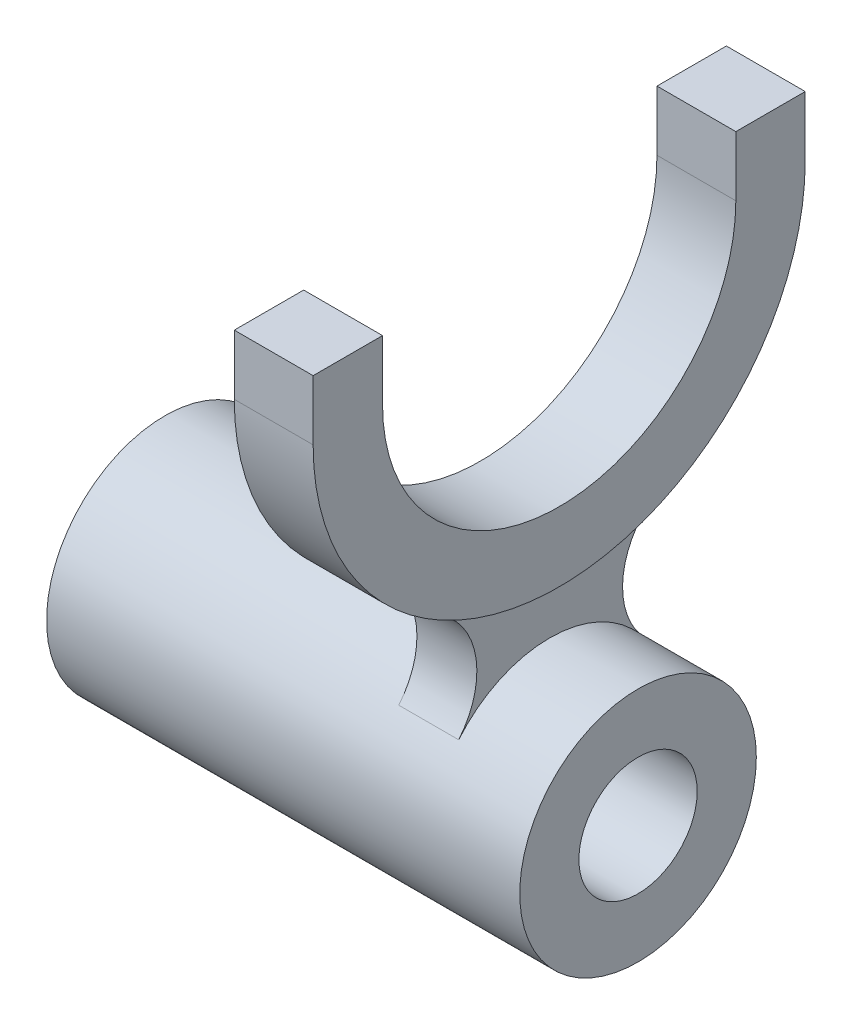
ISO-10303-21;
HEADER;
FILE_DESCRIPTION(('STEP AP214'),'2;1');
FILE_NAME('part.step','',(''),(''),'','','');
FILE_SCHEMA(('AUTOMOTIVE_DESIGN { 1 0 10303 214 1 1 1 1 }'));
ENDSEC;
DATA;
#1=APPLICATION_CONTEXT('core data for automotive mechanical design processes');
#2=APPLICATION_PROTOCOL_DEFINITION('international standard','automotive_design',2000,#1);
#3=PRODUCT_CONTEXT('',#1,'mechanical');
#4=PRODUCT('Part','Part','',(#3));
#5=PRODUCT_RELATED_PRODUCT_CATEGORY('part','',(#4));
#6=PRODUCT_DEFINITION_FORMATION('','',#4);
#7=PRODUCT_DEFINITION_CONTEXT('part definition',#1,'design');
#8=PRODUCT_DEFINITION('design','',#6,#7);
#9=PRODUCT_DEFINITION_SHAPE('','',#8);
#10=(LENGTH_UNIT() NAMED_UNIT(*) SI_UNIT(.MILLI.,.METRE.));
#11=(NAMED_UNIT(*) PLANE_ANGLE_UNIT() SI_UNIT($,.RADIAN.));
#12=(NAMED_UNIT(*) SI_UNIT($,.STERADIAN.) SOLID_ANGLE_UNIT());
#13=UNCERTAINTY_MEASURE_WITH_UNIT(LENGTH_MEASURE(1.E-05),#10,'distance_accuracy_value','');
#14=(GEOMETRIC_REPRESENTATION_CONTEXT(3) GLOBAL_UNCERTAINTY_ASSIGNED_CONTEXT((#13)) GLOBAL_UNIT_ASSIGNED_CONTEXT((#10,
#11,#12)) REPRESENTATION_CONTEXT('',''));
#15=CARTESIAN_POINT('',(0.,0.,0.));
#16=DIRECTION('',(0.,0.,1.));
#17=DIRECTION('',(1.,0.,0.));
#18=AXIS2_PLACEMENT_3D('',#15,#16,#17);
#19=CARTESIAN_POINT('',(-57.15,0.,0.));
#20=DIRECTION('',(1.,0.,0.));
#21=DIRECTION('',(0.,0.,-1.));
#22=AXIS2_PLACEMENT_3D('',#19,#20,#21);
#23=CYLINDRICAL_SURFACE('',#22,19.05);
#24=CARTESIAN_POINT('',(4.826,0.,0.));
#25=DIRECTION('',(-1.,0.,0.));
#26=DIRECTION('',(0.,0.,-1.));
#27=AXIS2_PLACEMENT_3D('',#24,#25,#26);
#28=CIRCLE('',#27,19.05);
#29=CARTESIAN_POINT('',(4.826,12.1666969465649,14.6585806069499));
#30=VERTEX_POINT('',#29);
#31=CARTESIAN_POINT('',(4.826,12.1666969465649,-14.6585806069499));
#32=VERTEX_POINT('',#31);
#33=EDGE_CURVE('E200',#30,#32,#28,.T.);
#34=ORIENTED_EDGE('',*,*,#33,.F.);
#35=DIRECTION('',(-1.,0.,0.));
#36=VECTOR('',#35,1.);
#37=CARTESIAN_POINT('',(4.826,12.1666969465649,14.6585806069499));
#38=LINE('',#37,#36);
#39=CARTESIAN_POINT('',(-4.826,12.1666969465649,14.6585806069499));
#40=VERTEX_POINT('',#39);
#41=EDGE_CURVE('E222',#30,#40,#38,.T.);
#42=ORIENTED_EDGE('',*,*,#41,.T.);
#43=CARTESIAN_POINT('',(-4.826,0.,0.));
#44=DIRECTION('',(-1.,0.,0.));
#45=DIRECTION('',(0.,0.,-1.));
#46=AXIS2_PLACEMENT_3D('',#43,#44,#45);
#47=CIRCLE('',#46,19.05);
#48=CARTESIAN_POINT('',(-4.826,12.1666969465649,-14.6585806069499));
#49=VERTEX_POINT('',#48);
#50=EDGE_CURVE('E209',#40,#49,#47,.T.);
#51=ORIENTED_EDGE('',*,*,#50,.T.);
#52=DIRECTION('',(-1.,0.,0.));
#53=VECTOR('',#52,1.);
#54=CARTESIAN_POINT('',(4.826,12.1666969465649,-14.6585806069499));
#55=LINE('',#54,#53);
#56=EDGE_CURVE('E220',#32,#49,#55,.T.);
#57=ORIENTED_EDGE('',*,*,#56,.F.);
#58=EDGE_LOOP('',(#34,#42,#51,#57));
#59=FACE_BOUND('',#58,.T.);
#60=CARTESIAN_POINT('',(-57.15,0.,0.));
#61=DIRECTION('',(1.,0.,0.));
#62=DIRECTION('',(0.,0.,-1.));
#63=AXIS2_PLACEMENT_3D('',#60,#61,#62);
#64=CIRCLE('',#63,19.05);
#65=CARTESIAN_POINT('',(-57.15,0.,-19.05));
#66=VERTEX_POINT('',#65);
#67=EDGE_CURVE('E11',#66,#66,#64,.T.);
#68=ORIENTED_EDGE('',*,*,#67,.T.);
#69=EDGE_LOOP('',(#68));
#70=FACE_BOUND('',#69,.T.);
#71=CARTESIAN_POINT('',(19.05,0.,0.));
#72=DIRECTION('',(1.,0.,0.));
#73=DIRECTION('',(0.,0.,-1.));
#74=AXIS2_PLACEMENT_3D('',#71,#72,#73);
#75=CIRCLE('',#74,19.05);
#76=CARTESIAN_POINT('',(19.05,0.,-19.05));
#77=VERTEX_POINT('',#76);
#78=EDGE_CURVE('E228',#77,#77,#75,.T.);
#79=ORIENTED_EDGE('',*,*,#78,.F.);
#80=EDGE_LOOP('',(#79));
#81=FACE_BOUND('',#80,.T.);
#82=ADVANCED_FACE('F33',(#59,#70,#81),#23,.T.);
#83=CARTESIAN_POINT('',(-57.15,0.,0.));
#84=DIRECTION('',(1.,0.,0.));
#85=DIRECTION('',(0.,0.,-1.));
#86=AXIS2_PLACEMENT_3D('',#83,#84,#85);
#87=PLANE('',#86);
#88=CARTESIAN_POINT('',(-57.15,0.,0.));
#89=DIRECTION('',(1.,0.,0.));
#90=DIRECTION('',(0.,0.,-1.));
#91=AXIS2_PLACEMENT_3D('',#88,#89,#90);
#92=CIRCLE('',#91,9.525);
#93=CARTESIAN_POINT('',(-57.15,0.,-9.525));
#94=VERTEX_POINT('',#93);
#95=EDGE_CURVE('E40',#94,#94,#92,.T.);
#96=ORIENTED_EDGE('',*,*,#95,.T.);
#97=EDGE_LOOP('',(#96));
#98=FACE_BOUND('',#97,.T.);
#99=ORIENTED_EDGE('',*,*,#67,.F.);
#100=EDGE_LOOP('',(#99));
#101=FACE_BOUND('',#100,.T.);
#102=ADVANCED_FACE('F233',(#98,#101),#87,.F.);
#103=CARTESIAN_POINT('',(-57.15,0.,0.));
#104=DIRECTION('',(1.,0.,0.));
#105=DIRECTION('',(0.,0.,-1.));
#106=AXIS2_PLACEMENT_3D('',#103,#104,#105);
#107=CYLINDRICAL_SURFACE('',#106,9.525);
#108=ORIENTED_EDGE('',*,*,#95,.F.);
#109=EDGE_LOOP('',(#108));
#110=FACE_BOUND('',#109,.T.);
#111=CARTESIAN_POINT('',(19.05,0.,0.));
#112=DIRECTION('',(1.,0.,0.));
#113=DIRECTION('',(0.,0.,-1.));
#114=AXIS2_PLACEMENT_3D('',#111,#112,#113);
#115=CIRCLE('',#114,9.525);
#116=CARTESIAN_POINT('',(19.05,0.,-9.525));
#117=VERTEX_POINT('',#116);
#118=EDGE_CURVE('E225',#117,#117,#115,.T.);
#119=ORIENTED_EDGE('',*,*,#118,.T.);
#120=EDGE_LOOP('',(#119));
#121=FACE_BOUND('',#120,.T.);
#122=ADVANCED_FACE('F236',(#110,#121),#107,.F.);
#123=CARTESIAN_POINT('',(19.05,0.,0.));
#124=DIRECTION('',(1.,0.,0.));
#125=DIRECTION('',(0.,0.,-1.));
#126=AXIS2_PLACEMENT_3D('',#123,#124,#125);
#127=PLANE('',#126);
#128=ORIENTED_EDGE('',*,*,#78,.T.);
#129=EDGE_LOOP('',(#128));
#130=FACE_BOUND('',#129,.T.);
#131=ORIENTED_EDGE('',*,*,#118,.F.);
#132=EDGE_LOOP('',(#131));
#133=FACE_BOUND('',#132,.T.);
#134=ADVANCED_FACE('F239',(#130,#133),#127,.T.);
#135=CARTESIAN_POINT('',(4.826,20.2778282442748,24.4309676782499));
#136=DIRECTION('',(-1.,0.,0.));
#137=DIRECTION('',(0.,0.,1.));
#138=AXIS2_PLACEMENT_3D('',#135,#136,#137);
#139=CYLINDRICAL_SURFACE('',#138,12.7);
#140=CARTESIAN_POINT('',(-4.826,20.2778282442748,24.4309676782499));
#141=DIRECTION('',(-1.,0.,0.));
#142=DIRECTION('',(0.,0.,-1.));
#143=AXIS2_PLACEMENT_3D('',#140,#141,#142);
#144=CIRCLE('',#143,12.7);
#145=CARTESIAN_POINT('',(-4.826,31.5084524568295,18.5011211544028));
#146=VERTEX_POINT('',#145);
#147=EDGE_CURVE('E147',#146,#40,#144,.T.);
#148=ORIENTED_EDGE('',*,*,#147,.T.);
#149=ORIENTED_EDGE('',*,*,#41,.F.);
#150=CARTESIAN_POINT('',(4.826,20.2778282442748,24.4309676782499));
#151=DIRECTION('',(-1.,0.,0.));
#152=DIRECTION('',(0.,0.,-1.));
#153=AXIS2_PLACEMENT_3D('',#150,#151,#152);
#154=CIRCLE('',#153,12.7);
#155=CARTESIAN_POINT('',(4.826,31.5084524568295,18.5011211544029));
#156=VERTEX_POINT('',#155);
#157=EDGE_CURVE('E70',#156,#30,#154,.T.);
#158=ORIENTED_EDGE('',*,*,#157,.F.);
#159=DIRECTION('',(-1.,0.,0.));
#160=VECTOR('',#159,1.);
#161=CARTESIAN_POINT('',(4.826,31.5084524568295,18.5011211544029));
#162=LINE('',#161,#160);
#163=EDGE_CURVE('E206',#156,#146,#162,.T.);
#164=ORIENTED_EDGE('',*,*,#163,.T.);
#165=EDGE_LOOP('',(#148,#149,#158,#164));
#166=FACE_BOUND('',#165,.T.);
#167=ADVANCED_FACE('F244',(#166),#139,.F.);
#168=CARTESIAN_POINT('',(4.826,20.2778282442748,-24.4309676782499));
#169=DIRECTION('',(-1.,0.,0.));
#170=DIRECTION('',(0.,0.,1.));
#171=AXIS2_PLACEMENT_3D('',#168,#169,#170);
#172=CYLINDRICAL_SURFACE('',#171,12.7);
#173=CARTESIAN_POINT('',(-4.826,20.2778282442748,-24.4309676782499));
#174=DIRECTION('',(-1.,0.,0.));
#175=DIRECTION('',(0.,0.,1.));
#176=AXIS2_PLACEMENT_3D('',#173,#174,#175);
#177=CIRCLE('',#176,12.7);
#178=CARTESIAN_POINT('',(-4.826,31.5084524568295,-18.5011211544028));
#179=VERTEX_POINT('',#178);
#180=EDGE_CURVE('E47',#49,#179,#177,.T.);
#181=ORIENTED_EDGE('',*,*,#180,.T.);
#182=DIRECTION('',(-1.,0.,0.));
#183=VECTOR('',#182,1.);
#184=CARTESIAN_POINT('',(4.826,31.5084524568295,-18.5011211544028));
#185=LINE('',#184,#183);
#186=CARTESIAN_POINT('',(4.826,31.5084524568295,-18.5011211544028));
#187=VERTEX_POINT('',#186);
#188=EDGE_CURVE('E217',#187,#179,#185,.T.);
#189=ORIENTED_EDGE('',*,*,#188,.F.);
#190=CARTESIAN_POINT('',(4.826,20.2778282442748,-24.4309676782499));
#191=DIRECTION('',(-1.,0.,0.));
#192=DIRECTION('',(0.,0.,1.));
#193=AXIS2_PLACEMENT_3D('',#190,#191,#192);
#194=CIRCLE('',#193,12.7);
#195=EDGE_CURVE('E203',#32,#187,#194,.T.);
#196=ORIENTED_EDGE('',*,*,#195,.F.);
#197=ORIENTED_EDGE('',*,*,#56,.T.);
#198=EDGE_LOOP('',(#181,#189,#196,#197));
#199=FACE_BOUND('',#198,.T.);
#200=ADVANCED_FACE('F250',(#199),#172,.F.);
#201=CARTESIAN_POINT('',(4.826,43.4129141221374,12.2154838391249));
#202=DIRECTION('',(1.,0.,0.));
#203=DIRECTION('',(0.,0.,-1.));
#204=AXIS2_PLACEMENT_3D('',#201,#202,#203);
#205=PLANE('',#204);
#206=ORIENTED_EDGE('',*,*,#157,.T.);
#207=ORIENTED_EDGE('',*,*,#33,.T.);
#208=ORIENTED_EDGE('',*,*,#195,.T.);
#209=CARTESIAN_POINT('',(4.826,66.548,0.));
#210=DIRECTION('',(-1.,0.,0.));
#211=DIRECTION('',(0.,0.,-1.));
#212=AXIS2_PLACEMENT_3D('',#209,#210,#211);
#213=CIRCLE('',#212,39.624);
#214=EDGE_CURVE('E56',#187,#156,#213,.T.);
#215=ORIENTED_EDGE('',*,*,#214,.T.);
#216=EDGE_LOOP('',(#206,#207,#208,#215));
#217=FACE_BOUND('',#216,.T.);
#218=ADVANCED_FACE('F265',(#217),#205,.T.);
#219=CARTESIAN_POINT('',(-4.826,43.4129141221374,12.2154838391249));
#220=DIRECTION('',(1.,0.,0.));
#221=DIRECTION('',(0.,0.,-1.));
#222=AXIS2_PLACEMENT_3D('',#219,#220,#221);
#223=PLANE('',#222);
#224=ORIENTED_EDGE('',*,*,#147,.F.);
#225=CARTESIAN_POINT('',(-4.826,66.548,0.));
#226=DIRECTION('',(-1.,0.,0.));
#227=DIRECTION('',(0.,0.,-1.));
#228=AXIS2_PLACEMENT_3D('',#225,#226,#227);
#229=CIRCLE('',#228,39.624);
#230=EDGE_CURVE('E201',#179,#146,#229,.T.);
#231=ORIENTED_EDGE('',*,*,#230,.F.);
#232=ORIENTED_EDGE('',*,*,#180,.F.);
#233=ORIENTED_EDGE('',*,*,#50,.F.);
#234=EDGE_LOOP('',(#224,#231,#232,#233));
#235=FACE_BOUND('',#234,.T.);
#236=ADVANCED_FACE('F270',(#235),#223,.F.);
#237=CARTESIAN_POINT('',(6.35,66.548,28.448));
#238=DIRECTION('',(0.,0.,1.));
#239=DIRECTION('',(1.,0.,0.));
#240=AXIS2_PLACEMENT_3D('',#237,#238,#239);
#241=PLANE('',#240);
#242=DIRECTION('',(0.,1.,0.));
#243=VECTOR('',#242,1.);
#244=CARTESIAN_POINT('',(-6.35,66.548,28.448));
#245=LINE('',#244,#243);
#246=CARTESIAN_POINT('',(-6.35,66.548,28.448));
#247=VERTEX_POINT('',#246);
#248=CARTESIAN_POINT('',(-6.35,76.2,28.448));
#249=VERTEX_POINT('',#248);
#250=EDGE_CURVE('E143',#247,#249,#245,.T.);
#251=ORIENTED_EDGE('',*,*,#250,.T.);
#252=DIRECTION('',(-1.,0.,0.));
#253=VECTOR('',#252,1.);
#254=CARTESIAN_POINT('',(6.35,76.2,28.448));
#255=LINE('',#254,#253);
#256=CARTESIAN_POINT('',(6.35,76.2,28.448));
#257=VERTEX_POINT('',#256);
#258=EDGE_CURVE('E140',#257,#249,#255,.T.);
#259=ORIENTED_EDGE('',*,*,#258,.F.);
#260=DIRECTION('',(0.,1.,0.));
#261=VECTOR('',#260,1.);
#262=CARTESIAN_POINT('',(6.35,66.548,28.448));
#263=LINE('',#262,#261);
#264=CARTESIAN_POINT('',(6.35,66.548,28.448));
#265=VERTEX_POINT('',#264);
#266=EDGE_CURVE('E125',#265,#257,#263,.T.);
#267=ORIENTED_EDGE('',*,*,#266,.F.);
#268=DIRECTION('',(-1.,0.,0.));
#269=VECTOR('',#268,1.);
#270=CARTESIAN_POINT('',(6.35,66.548,28.448));
#271=LINE('',#270,#269);
#272=EDGE_CURVE('E167',#265,#247,#271,.T.);
#273=ORIENTED_EDGE('',*,*,#272,.T.);
#274=EDGE_LOOP('',(#251,#259,#267,#273));
#275=FACE_BOUND('',#274,.T.);
#276=ADVANCED_FACE('F141',(#275),#241,.F.);
#277=CARTESIAN_POINT('',(6.35,76.2,39.624));
#278=DIRECTION('',(0.,1.,0.));
#279=DIRECTION('',(0.,0.,1.));
#280=AXIS2_PLACEMENT_3D('',#277,#278,#279);
#281=PLANE('',#280);
#282=DIRECTION('',(0.,0.,-1.));
#283=VECTOR('',#282,1.);
#284=CARTESIAN_POINT('',(-6.35,76.2,39.624));
#285=LINE('',#284,#283);
#286=CARTESIAN_POINT('',(-6.35,76.2,39.624));
#287=VERTEX_POINT('',#286);
#288=EDGE_CURVE('E169',#287,#249,#285,.T.);
#289=ORIENTED_EDGE('',*,*,#288,.F.);
#290=DIRECTION('',(-1.,0.,0.));
#291=VECTOR('',#290,1.);
#292=CARTESIAN_POINT('',(6.35,76.2,39.624));
#293=LINE('',#292,#291);
#294=CARTESIAN_POINT('',(6.35,76.2,39.624));
#295=VERTEX_POINT('',#294);
#296=EDGE_CURVE('E148',#295,#287,#293,.T.);
#297=ORIENTED_EDGE('',*,*,#296,.F.);
#298=DIRECTION('',(0.,0.,-1.));
#299=VECTOR('',#298,1.);
#300=CARTESIAN_POINT('',(6.35,76.2,39.624));
#301=LINE('',#300,#299);
#302=EDGE_CURVE('E130',#295,#257,#301,.T.);
#303=ORIENTED_EDGE('',*,*,#302,.T.);
#304=ORIENTED_EDGE('',*,*,#258,.T.);
#305=EDGE_LOOP('',(#289,#297,#303,#304));
#306=FACE_BOUND('',#305,.T.);
#307=ADVANCED_FACE('F150',(#306),#281,.T.);
#308=CARTESIAN_POINT('',(6.35,66.548,39.624));
#309=DIRECTION('',(0.,0.,1.));
#310=DIRECTION('',(1.,0.,0.));
#311=AXIS2_PLACEMENT_3D('',#308,#309,#310);
#312=PLANE('',#311);
#313=DIRECTION('',(0.,1.,0.));
#314=VECTOR('',#313,1.);
#315=CARTESIAN_POINT('',(-6.35,66.548,39.624));
#316=LINE('',#315,#314);
#317=CARTESIAN_POINT('',(-6.35,66.548,39.624));
#318=VERTEX_POINT('',#317);
#319=EDGE_CURVE('E171',#318,#287,#316,.T.);
#320=ORIENTED_EDGE('',*,*,#319,.F.);
#321=DIRECTION('',(-1.,0.,0.));
#322=VECTOR('',#321,1.);
#323=CARTESIAN_POINT('',(6.35,66.548,39.624));
#324=LINE('',#323,#322);
#325=CARTESIAN_POINT('',(6.35,66.548,39.624));
#326=VERTEX_POINT('',#325);
#327=EDGE_CURVE('E196',#326,#318,#324,.T.);
#328=ORIENTED_EDGE('',*,*,#327,.F.);
#329=DIRECTION('',(0.,1.,0.));
#330=VECTOR('',#329,1.);
#331=CARTESIAN_POINT('',(6.35,66.548,39.624));
#332=LINE('',#331,#330);
#333=EDGE_CURVE('E151',#326,#295,#332,.T.);
#334=ORIENTED_EDGE('',*,*,#333,.T.);
#335=ORIENTED_EDGE('',*,*,#296,.T.);
#336=EDGE_LOOP('',(#320,#328,#334,#335));
#337=FACE_BOUND('',#336,.T.);
#338=ADVANCED_FACE('F309',(#337),#312,.T.);
#339=CARTESIAN_POINT('',(6.35,66.548,0.));
#340=DIRECTION('',(-1.,0.,0.));
#341=DIRECTION('',(0.,0.,1.));
#342=AXIS2_PLACEMENT_3D('',#339,#340,#341);
#343=CYLINDRICAL_SURFACE('',#342,39.624);
#344=ORIENTED_EDGE('',*,*,#163,.F.);
#345=ORIENTED_EDGE('',*,*,#214,.F.);
#346=ORIENTED_EDGE('',*,*,#188,.T.);
#347=ORIENTED_EDGE('',*,*,#230,.T.);
#348=EDGE_LOOP('',(#344,#345,#346,#347));
#349=FACE_BOUND('',#348,.T.);
#350=CARTESIAN_POINT('',(-6.35,66.548,0.));
#351=DIRECTION('',(-1.,0.,0.));
#352=DIRECTION('',(0.,0.,-1.));
#353=AXIS2_PLACEMENT_3D('',#350,#351,#352);
#354=CIRCLE('',#353,39.624);
#355=CARTESIAN_POINT('',(-6.35,66.548,-39.624));
#356=VERTEX_POINT('',#355);
#357=EDGE_CURVE('E174',#356,#318,#354,.T.);
#358=ORIENTED_EDGE('',*,*,#357,.F.);
#359=DIRECTION('',(-1.,0.,0.));
#360=VECTOR('',#359,1.);
#361=CARTESIAN_POINT('',(6.35,66.548,-39.624));
#362=LINE('',#361,#360);
#363=CARTESIAN_POINT('',(6.35,66.548,-39.624));
#364=VERTEX_POINT('',#363);
#365=EDGE_CURVE('E194',#364,#356,#362,.T.);
#366=ORIENTED_EDGE('',*,*,#365,.F.);
#367=CARTESIAN_POINT('',(6.35,66.548,0.));
#368=DIRECTION('',(-1.,0.,0.));
#369=DIRECTION('',(0.,0.,-1.));
#370=AXIS2_PLACEMENT_3D('',#367,#368,#369);
#371=CIRCLE('',#370,39.624);
#372=EDGE_CURVE('E153',#364,#326,#371,.T.);
#373=ORIENTED_EDGE('',*,*,#372,.T.);
#374=ORIENTED_EDGE('',*,*,#327,.T.);
#375=EDGE_LOOP('',(#358,#366,#373,#374));
#376=FACE_BOUND('',#375,.T.);
#377=ADVANCED_FACE('F268',(#349,#376),#343,.T.);
#378=CARTESIAN_POINT('',(6.35,66.548,-39.624));
#379=DIRECTION('',(0.,0.,-1.));
#380=DIRECTION('',(-1.,0.,0.));
#381=AXIS2_PLACEMENT_3D('',#378,#379,#380);
#382=PLANE('',#381);
#383=DIRECTION('',(0.,-1.,0.));
#384=VECTOR('',#383,1.);
#385=CARTESIAN_POINT('',(-6.35,66.548,-39.624));
#386=LINE('',#385,#384);
#387=CARTESIAN_POINT('',(-6.35,76.2,-39.624));
#388=VERTEX_POINT('',#387);
#389=EDGE_CURVE('E177',#388,#356,#386,.T.);
#390=ORIENTED_EDGE('',*,*,#389,.F.);
#391=DIRECTION('',(-1.,0.,0.));
#392=VECTOR('',#391,1.);
#393=CARTESIAN_POINT('',(6.35,76.2,-39.624));
#394=LINE('',#393,#392);
#395=CARTESIAN_POINT('',(6.35,76.2,-39.624));
#396=VERTEX_POINT('',#395);
#397=EDGE_CURVE('E192',#396,#388,#394,.T.);
#398=ORIENTED_EDGE('',*,*,#397,.F.);
#399=DIRECTION('',(0.,-1.,0.));
#400=VECTOR('',#399,1.);
#401=CARTESIAN_POINT('',(6.35,66.548,-39.624));
#402=LINE('',#401,#400);
#403=EDGE_CURVE('E158',#396,#364,#402,.T.);
#404=ORIENTED_EDGE('',*,*,#403,.T.);
#405=ORIENTED_EDGE('',*,*,#365,.T.);
#406=EDGE_LOOP('',(#390,#398,#404,#405));
#407=FACE_BOUND('',#406,.T.);
#408=ADVANCED_FACE('F327',(#407),#382,.T.);
#409=CARTESIAN_POINT('',(6.35,76.2,-28.448));
#410=DIRECTION('',(0.,1.,0.));
#411=DIRECTION('',(0.,0.,1.));
#412=AXIS2_PLACEMENT_3D('',#409,#410,#411);
#413=PLANE('',#412);
#414=DIRECTION('',(0.,0.,-1.));
#415=VECTOR('',#414,1.);
#416=CARTESIAN_POINT('',(-6.35,76.2,-28.448));
#417=LINE('',#416,#415);
#418=CARTESIAN_POINT('',(-6.35,76.2,-28.448));
#419=VERTEX_POINT('',#418);
#420=EDGE_CURVE('E180',#419,#388,#417,.T.);
#421=ORIENTED_EDGE('',*,*,#420,.F.);
#422=DIRECTION('',(-1.,0.,0.));
#423=VECTOR('',#422,1.);
#424=CARTESIAN_POINT('',(6.35,76.2,-28.448));
#425=LINE('',#424,#423);
#426=CARTESIAN_POINT('',(6.35,76.2,-28.448));
#427=VERTEX_POINT('',#426);
#428=EDGE_CURVE('E190',#427,#419,#425,.T.);
#429=ORIENTED_EDGE('',*,*,#428,.F.);
#430=DIRECTION('',(0.,0.,-1.));
#431=VECTOR('',#430,1.);
#432=CARTESIAN_POINT('',(6.35,76.2,-28.448));
#433=LINE('',#432,#431);
#434=EDGE_CURVE('E161',#427,#396,#433,.T.);
#435=ORIENTED_EDGE('',*,*,#434,.T.);
#436=ORIENTED_EDGE('',*,*,#397,.T.);
#437=EDGE_LOOP('',(#421,#429,#435,#436));
#438=FACE_BOUND('',#437,.T.);
#439=ADVANCED_FACE('F336',(#438),#413,.T.);
#440=CARTESIAN_POINT('',(6.35,66.548,-28.448));
#441=DIRECTION('',(0.,0.,-1.));
#442=DIRECTION('',(-1.,0.,0.));
#443=AXIS2_PLACEMENT_3D('',#440,#441,#442);
#444=PLANE('',#443);
#445=DIRECTION('',(0.,1.,0.));
#446=VECTOR('',#445,1.);
#447=CARTESIAN_POINT('',(-6.35,66.548,-28.448));
#448=LINE('',#447,#446);
#449=CARTESIAN_POINT('',(-6.35,66.548,-28.448));
#450=VERTEX_POINT('',#449);
#451=EDGE_CURVE('E183',#419,#450,#448,.F.);
#452=ORIENTED_EDGE('',*,*,#451,.T.);
#453=DIRECTION('',(-1.,0.,0.));
#454=VECTOR('',#453,1.);
#455=CARTESIAN_POINT('',(6.35,66.548,-28.448));
#456=LINE('',#455,#454);
#457=CARTESIAN_POINT('',(6.35,66.548,-28.448));
#458=VERTEX_POINT('',#457);
#459=EDGE_CURVE('E187',#458,#450,#456,.T.);
#460=ORIENTED_EDGE('',*,*,#459,.F.);
#461=DIRECTION('',(0.,1.,0.));
#462=VECTOR('',#461,1.);
#463=CARTESIAN_POINT('',(6.35,66.548,-28.448));
#464=LINE('',#463,#462);
#465=EDGE_CURVE('E164',#427,#458,#464,.F.);
#466=ORIENTED_EDGE('',*,*,#465,.F.);
#467=ORIENTED_EDGE('',*,*,#428,.T.);
#468=EDGE_LOOP('',(#452,#460,#466,#467));
#469=FACE_BOUND('',#468,.T.);
#470=ADVANCED_FACE('F346',(#469),#444,.F.);
#471=CARTESIAN_POINT('',(6.35,66.548,0.));
#472=DIRECTION('',(-1.,0.,0.));
#473=DIRECTION('',(0.,0.,1.));
#474=AXIS2_PLACEMENT_3D('',#471,#472,#473);
#475=CYLINDRICAL_SURFACE('',#474,28.448);
#476=CARTESIAN_POINT('',(-6.35,66.548,0.));
#477=DIRECTION('',(1.,0.,0.));
#478=DIRECTION('',(0.,0.,-1.));
#479=AXIS2_PLACEMENT_3D('',#476,#477,#478);
#480=CIRCLE('',#479,28.448);
#481=EDGE_CURVE('E137',#450,#247,#480,.F.);
#482=ORIENTED_EDGE('',*,*,#481,.T.);
#483=ORIENTED_EDGE('',*,*,#272,.F.);
#484=CARTESIAN_POINT('',(6.35,66.548,0.));
#485=DIRECTION('',(1.,0.,0.));
#486=DIRECTION('',(0.,0.,-1.));
#487=AXIS2_PLACEMENT_3D('',#484,#485,#486);
#488=CIRCLE('',#487,28.448);
#489=EDGE_CURVE('E133',#458,#265,#488,.F.);
#490=ORIENTED_EDGE('',*,*,#489,.F.);
#491=ORIENTED_EDGE('',*,*,#459,.T.);
#492=EDGE_LOOP('',(#482,#483,#490,#491));
#493=FACE_BOUND('',#492,.T.);
#494=ADVANCED_FACE('F356',(#493),#475,.F.);
#495=CARTESIAN_POINT('',(6.35,66.548,0.));
#496=DIRECTION('',(-1.,0.,0.));
#497=DIRECTION('',(0.,0.,1.));
#498=AXIS2_PLACEMENT_3D('',#495,#496,#497);
#499=PLANE('',#498);
#500=ORIENTED_EDGE('',*,*,#266,.T.);
#501=ORIENTED_EDGE('',*,*,#302,.F.);
#502=ORIENTED_EDGE('',*,*,#333,.F.);
#503=ORIENTED_EDGE('',*,*,#372,.F.);
#504=ORIENTED_EDGE('',*,*,#403,.F.);
#505=ORIENTED_EDGE('',*,*,#434,.F.);
#506=ORIENTED_EDGE('',*,*,#465,.T.);
#507=ORIENTED_EDGE('',*,*,#489,.T.);
#508=EDGE_LOOP('',(#500,#501,#502,#503,#504,#505,#506,#507));
#509=FACE_BOUND('',#508,.T.);
#510=ADVANCED_FACE('F127',(#509),#499,.F.);
#511=CARTESIAN_POINT('',(-6.35,66.548,0.));
#512=DIRECTION('',(-1.,0.,0.));
#513=DIRECTION('',(0.,0.,1.));
#514=AXIS2_PLACEMENT_3D('',#511,#512,#513);
#515=PLANE('',#514);
#516=ORIENTED_EDGE('',*,*,#250,.F.);
#517=ORIENTED_EDGE('',*,*,#481,.F.);
#518=ORIENTED_EDGE('',*,*,#451,.F.);
#519=ORIENTED_EDGE('',*,*,#420,.T.);
#520=ORIENTED_EDGE('',*,*,#389,.T.);
#521=ORIENTED_EDGE('',*,*,#357,.T.);
#522=ORIENTED_EDGE('',*,*,#319,.T.);
#523=ORIENTED_EDGE('',*,*,#288,.T.);
#524=EDGE_LOOP('',(#516,#517,#518,#519,#520,#521,#522,#523));
#525=FACE_BOUND('',#524,.T.);
#526=ADVANCED_FACE('F375',(#525),#515,.T.);
#527=CLOSED_SHELL('',(#82,#102,#122,#134,#167,#200,#218,#236,#276,#307,#338,#377,#408,#439,#470,
#494,#510,#526));
#528=MANIFOLD_SOLID_BREP('B2',#527);
#529=ADVANCED_BREP_SHAPE_REPRESENTATION('',(#18,#528),#14);
#530=SHAPE_DEFINITION_REPRESENTATION(#9,#529);
ENDSEC;
END-ISO-10303-21;
